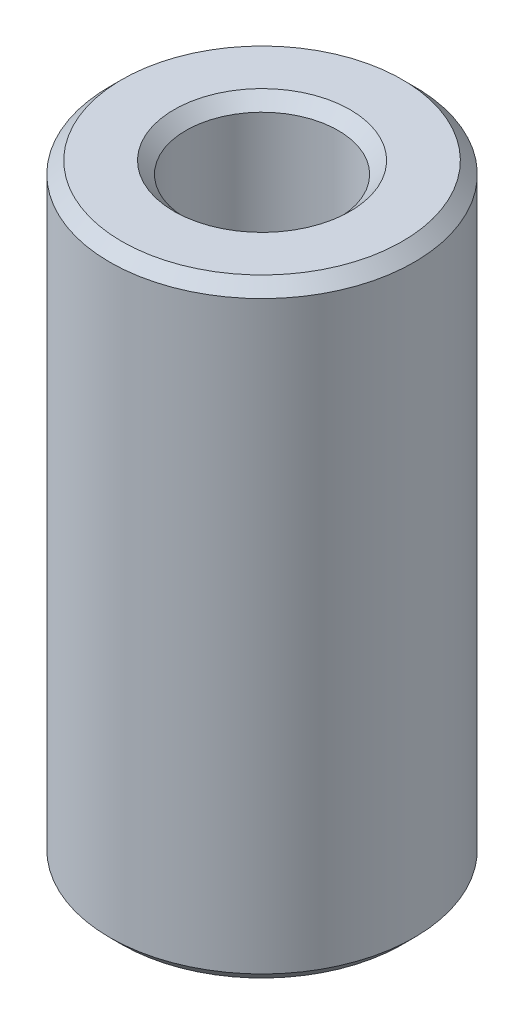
from build123d import *

# Parameters (mm, degrees)
SKETCH1_R           = 6.35
SKETCH1_R_2         = 3.175
BOSS_EXTRUDE1_DEPTH = 25.4
CHAMFER1_SIZE       = 0.5


with BuildPart() as part:
    # Sketch1 → Boss-Extrude1 (new body)
    with BuildSketch(Plane(origin=(0, 0, 0), x_dir=(1, 0, 0), z_dir=(0, 1, 0))):
        with Locations(Location((0, 0, 0), (0, 0, 270))):
            Circle(SKETCH1_R)
        with Locations(Location((0, 0, 0), (0, 0, 270))):
            Circle(SKETCH1_R_2, mode=Mode.SUBTRACT)
    extrude(amount=BOSS_EXTRUDE1_DEPTH)

    # Chamfer1
    chamfer1_edges = [part.edges().sort_by_distance(p)[0] for p in [
        (0, 0, -6.35),
        (0, 25.4, -6.35),
        (0, 0, -3.175),
        (0, 25.4, -3.175),
    ]]
    chamfer(chamfer1_edges, length=CHAMFER1_SIZE)


solid = part.part
